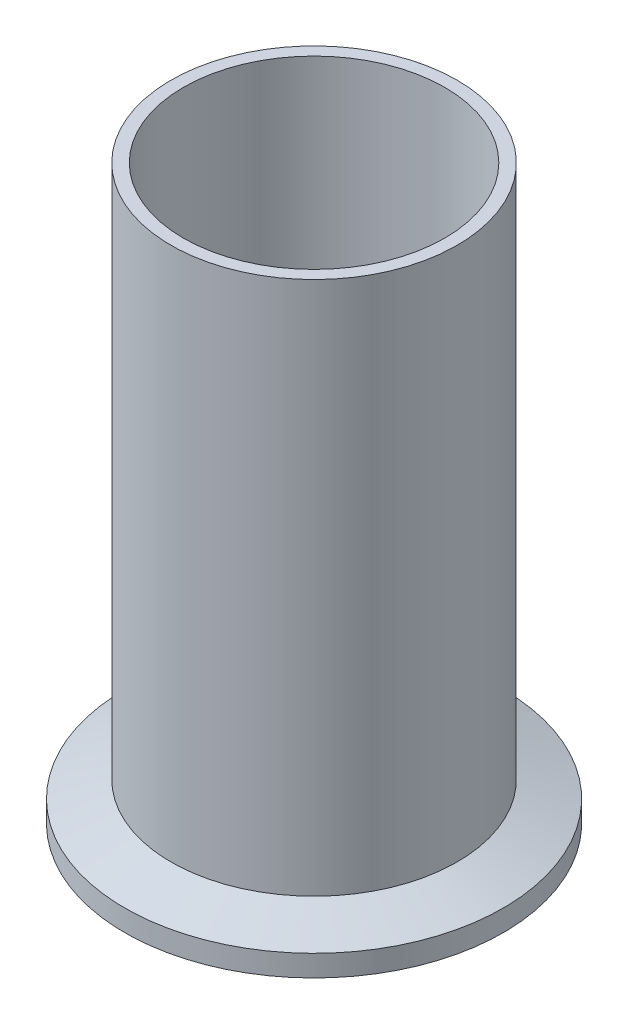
ISO-10303-21;
HEADER;
FILE_DESCRIPTION(('STEP AP214'),'2;1');
FILE_NAME('part.step','',(''),(''),'','','');
FILE_SCHEMA(('AUTOMOTIVE_DESIGN { 1 0 10303 214 1 1 1 1 }'));
ENDSEC;
DATA;
#1=APPLICATION_CONTEXT('core data for automotive mechanical design processes');
#2=APPLICATION_PROTOCOL_DEFINITION('international standard','automotive_design',2000,#1);
#3=PRODUCT_CONTEXT('',#1,'mechanical');
#4=PRODUCT('Part','Part','',(#3));
#5=PRODUCT_RELATED_PRODUCT_CATEGORY('part','',(#4));
#6=PRODUCT_DEFINITION_FORMATION('','',#4);
#7=PRODUCT_DEFINITION_CONTEXT('part definition',#1,'design');
#8=PRODUCT_DEFINITION('design','',#6,#7);
#9=PRODUCT_DEFINITION_SHAPE('','',#8);
#10=(LENGTH_UNIT() NAMED_UNIT(*) SI_UNIT(.MILLI.,.METRE.));
#11=(NAMED_UNIT(*) PLANE_ANGLE_UNIT() SI_UNIT($,.RADIAN.));
#12=(NAMED_UNIT(*) SI_UNIT($,.STERADIAN.) SOLID_ANGLE_UNIT());
#13=UNCERTAINTY_MEASURE_WITH_UNIT(LENGTH_MEASURE(1.E-05),#10,'distance_accuracy_value','');
#14=(GEOMETRIC_REPRESENTATION_CONTEXT(3) GLOBAL_UNCERTAINTY_ASSIGNED_CONTEXT((#13)) GLOBAL_UNIT_ASSIGNED_CONTEXT((#10,
#11,#12)) REPRESENTATION_CONTEXT('',''));
#15=CARTESIAN_POINT('',(0.,0.,0.));
#16=DIRECTION('',(0.,0.,1.));
#17=DIRECTION('',(1.,0.,0.));
#18=AXIS2_PLACEMENT_3D('',#15,#16,#17);
#19=CARTESIAN_POINT('',(0.,0.787399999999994,0.));
#20=DIRECTION('',(0.,-0.999999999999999,0.));
#21=DIRECTION('',(0.,0.,-0.999999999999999));
#22=AXIS2_PLACEMENT_3D('',#19,#20,#21);
#23=TOROIDAL_SURFACE('',#22,23.6366084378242,0.787399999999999);
#24=CARTESIAN_POINT('',(0.,0.,0.));
#25=DIRECTION('',(0.,-0.999999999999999,0.));
#26=DIRECTION('',(0.,0.,-0.999999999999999));
#27=AXIS2_PLACEMENT_3D('',#24,#25,#26);
#28=CIRCLE('',#27,23.6366084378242);
#29=CARTESIAN_POINT('',(0.,0.,-23.6366084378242));
#30=VERTEX_POINT('',#29);
#31=EDGE_CURVE('E74',#30,#30,#28,.T.);
#32=ORIENTED_EDGE('',*,*,#31,.T.);
#33=EDGE_LOOP('',(#32));
#34=FACE_BOUND('',#33,.T.);
#35=CARTESIAN_POINT('',(0.,0.474458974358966,0.));
#36=DIRECTION('',(0.,-0.999999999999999,0.));
#37=DIRECTION('',(0.,0.,-0.999999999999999));
#38=AXIS2_PLACEMENT_3D('',#35,#36,#37);
#39=CIRCLE('',#38,22.9140666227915);
#40=CARTESIAN_POINT('',(0.,0.474458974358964,-22.9140666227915));
#41=VERTEX_POINT('',#40);
#42=EDGE_CURVE('E12',#41,#41,#39,.T.);
#43=ORIENTED_EDGE('',*,*,#42,.F.);
#44=EDGE_LOOP('',(#43));
#45=FACE_BOUND('',#44,.T.);
#46=ADVANCED_FACE('F40',(#34,#45),#23,.T.);
#47=CARTESIAN_POINT('',(0.,0.,0.));
#48=DIRECTION('',(0.,-0.999999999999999,0.));
#49=DIRECTION('',(0.,0.,-0.999999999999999));
#50=AXIS2_PLACEMENT_3D('',#47,#48,#49);
#51=TOROIDAL_SURFACE('',#50,21.8186,1.1938);
#52=CARTESIAN_POINT('',(0.,0.474458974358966,0.));
#53=DIRECTION('',(0.,-0.999999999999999,0.));
#54=DIRECTION('',(0.,0.,-0.999999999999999));
#55=AXIS2_PLACEMENT_3D('',#52,#53,#54);
#56=CIRCLE('',#55,20.7231333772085);
#57=CARTESIAN_POINT('',(0.,0.474458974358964,-20.7231333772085));
#58=VERTEX_POINT('',#57);
#59=EDGE_CURVE('E46',#58,#58,#56,.T.);
#60=ORIENTED_EDGE('',*,*,#59,.F.);
#61=EDGE_LOOP('',(#60));
#62=FACE_BOUND('',#61,.T.);
#63=ORIENTED_EDGE('',*,*,#42,.T.);
#64=EDGE_LOOP('',(#63));
#65=FACE_BOUND('',#64,.T.);
#66=ADVANCED_FACE('F122',(#62,#65),#51,.F.);
#67=CARTESIAN_POINT('',(0.,0.787399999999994,0.));
#68=DIRECTION('',(0.,-0.999999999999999,0.));
#69=DIRECTION('',(0.,0.,-0.999999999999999));
#70=AXIS2_PLACEMENT_3D('',#67,#68,#69);
#71=TOROIDAL_SURFACE('',#70,20.0005915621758,0.787399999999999);
#72=ORIENTED_EDGE('',*,*,#59,.T.);
#73=EDGE_LOOP('',(#72));
#74=FACE_BOUND('',#73,.T.);
#75=CARTESIAN_POINT('',(0.,0.,0.));
#76=DIRECTION('',(0.,-0.999999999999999,0.));
#77=DIRECTION('',(0.,0.,-0.999999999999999));
#78=AXIS2_PLACEMENT_3D('',#75,#76,#77);
#79=CIRCLE('',#78,20.0005915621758);
#80=CARTESIAN_POINT('',(0.,0.,-20.0005915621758));
#81=VERTEX_POINT('',#80);
#82=EDGE_CURVE('E50',#81,#81,#79,.T.);
#83=ORIENTED_EDGE('',*,*,#82,.F.);
#84=EDGE_LOOP('',(#83));
#85=FACE_BOUND('',#84,.T.);
#86=ADVANCED_FACE('F118',(#74,#85),#71,.T.);
#87=CARTESIAN_POINT('',(0.,0.,0.));
#88=DIRECTION('',(0.,0.999999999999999,0.));
#89=DIRECTION('',(0.,0.,0.999999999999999));
#90=AXIS2_PLACEMENT_3D('',#87,#88,#89);
#91=PLANE('',#90);
#92=CARTESIAN_POINT('',(0.,0.,0.));
#93=DIRECTION('',(0.,-0.999999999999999,0.));
#94=DIRECTION('',(0.,0.,-0.999999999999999));
#95=AXIS2_PLACEMENT_3D('',#92,#93,#94);
#96=CIRCLE('',#95,17.399);
#97=CARTESIAN_POINT('',(0.,0.,-17.399));
#98=VERTEX_POINT('',#97);
#99=EDGE_CURVE('E54',#98,#98,#96,.T.);
#100=ORIENTED_EDGE('',*,*,#99,.F.);
#101=EDGE_LOOP('',(#100));
#102=FACE_BOUND('',#101,.T.);
#103=ORIENTED_EDGE('',*,*,#82,.T.);
#104=EDGE_LOOP('',(#103));
#105=FACE_BOUND('',#104,.T.);
#106=ADVANCED_FACE('F112',(#102,#105),#91,.F.);
#107=CARTESIAN_POINT('',(0.,0.,0.));
#108=DIRECTION('',(0.,-0.999999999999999,0.));
#109=DIRECTION('',(0.,0.,-0.999999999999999));
#110=AXIS2_PLACEMENT_3D('',#107,#108,#109);
#111=CYLINDRICAL_SURFACE('',#110,17.399);
#112=CARTESIAN_POINT('',(0.,76.1999999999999,0.));
#113=DIRECTION('',(0.,-0.999999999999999,0.));
#114=DIRECTION('',(0.,0.,-0.999999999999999));
#115=AXIS2_PLACEMENT_3D('',#112,#113,#114);
#116=CIRCLE('',#115,17.399);
#117=CARTESIAN_POINT('',(0.,76.1999999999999,-17.399));
#118=VERTEX_POINT('',#117);
#119=EDGE_CURVE('E59',#118,#118,#116,.T.);
#120=CARTESIAN_POINT('',(0.,0.,-17.399));
#121=CARTESIAN_POINT('',(0.,0.793749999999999,-17.399));
#122=CARTESIAN_POINT('',(0.,1.5875,-17.399));
#123=CARTESIAN_POINT('',(0.,3.175,-17.399));
#124=CARTESIAN_POINT('',(0.,3.96875,-17.399));
#125=CARTESIAN_POINT('',(0.,5.55624999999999,-17.399));
#126=CARTESIAN_POINT('',(0.,6.34999999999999,-17.399));
#127=CARTESIAN_POINT('',(0.,7.93749999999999,-17.399));
#128=CARTESIAN_POINT('',(0.,8.73124999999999,-17.399));
#129=CARTESIAN_POINT('',(0.,10.31875,-17.399));
#130=CARTESIAN_POINT('',(0.,11.1125,-17.399));
#131=CARTESIAN_POINT('',(0.,12.7,-17.399));
#132=CARTESIAN_POINT('',(0.,13.49375,-17.399));
#133=CARTESIAN_POINT('',(0.,15.08125,-17.399));
#134=CARTESIAN_POINT('',(0.,15.875,-17.399));
#135=CARTESIAN_POINT('',(0.,17.4625,-17.399));
#136=CARTESIAN_POINT('',(0.,18.25625,-17.399));
#137=CARTESIAN_POINT('',(0.,19.84375,-17.399));
#138=CARTESIAN_POINT('',(0.,20.6375,-17.399));
#139=CARTESIAN_POINT('',(0.,22.225,-17.399));
#140=CARTESIAN_POINT('',(0.,23.01875,-17.399));
#141=CARTESIAN_POINT('',(0.,24.60625,-17.399));
#142=CARTESIAN_POINT('',(0.,25.4,-17.399));
#143=CARTESIAN_POINT('',(0.,26.9875,-17.399));
#144=CARTESIAN_POINT('',(0.,27.78125,-17.399));
#145=CARTESIAN_POINT('',(0.,29.36875,-17.399));
#146=CARTESIAN_POINT('',(0.,30.1625,-17.399));
#147=CARTESIAN_POINT('',(0.,31.75,-17.399));
#148=CARTESIAN_POINT('',(0.,32.54375,-17.399));
#149=CARTESIAN_POINT('',(0.,34.13125,-17.399));
#150=CARTESIAN_POINT('',(0.,34.9249999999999,-17.399));
#151=CARTESIAN_POINT('',(0.,36.5124999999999,-17.399));
#152=CARTESIAN_POINT('',(0.,37.3062499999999,-17.399));
#153=CARTESIAN_POINT('',(0.,38.8937499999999,-17.399));
#154=CARTESIAN_POINT('',(0.,39.6874999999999,-17.399));
#155=CARTESIAN_POINT('',(0.,41.2749999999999,-17.399));
#156=CARTESIAN_POINT('',(0.,42.0687499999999,-17.399));
#157=CARTESIAN_POINT('',(0.,43.6562499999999,-17.399));
#158=CARTESIAN_POINT('',(0.,44.4499999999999,-17.399));
#159=CARTESIAN_POINT('',(0.,46.0374999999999,-17.399));
#160=CARTESIAN_POINT('',(0.,46.8312499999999,-17.399));
#161=CARTESIAN_POINT('',(0.,48.4187499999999,-17.399));
#162=CARTESIAN_POINT('',(0.,49.2124999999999,-17.399));
#163=CARTESIAN_POINT('',(0.,50.7999999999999,-17.399));
#164=CARTESIAN_POINT('',(0.,51.5937499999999,-17.399));
#165=CARTESIAN_POINT('',(0.,53.1812499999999,-17.399));
#166=CARTESIAN_POINT('',(0.,53.9749999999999,-17.399));
#167=CARTESIAN_POINT('',(0.,55.5624999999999,-17.399));
#168=CARTESIAN_POINT('',(0.,56.3562499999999,-17.399));
#169=CARTESIAN_POINT('',(0.,57.9437499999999,-17.399));
#170=CARTESIAN_POINT('',(0.,58.7374999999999,-17.399));
#171=CARTESIAN_POINT('',(0.,60.3249999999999,-17.399));
#172=CARTESIAN_POINT('',(0.,61.1187499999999,-17.399));
#173=CARTESIAN_POINT('',(0.,62.7062499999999,-17.399));
#174=CARTESIAN_POINT('',(0.,63.4999999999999,-17.399));
#175=CARTESIAN_POINT('',(0.,65.0874999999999,-17.399));
#176=CARTESIAN_POINT('',(0.,65.8812499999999,-17.399));
#177=CARTESIAN_POINT('',(0.,67.4687499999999,-17.399));
#178=CARTESIAN_POINT('',(0.,68.2624999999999,-17.399));
#179=CARTESIAN_POINT('',(0.,69.8499999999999,-17.399));
#180=CARTESIAN_POINT('',(0.,70.6437499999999,-17.399));
#181=CARTESIAN_POINT('',(0.,72.2312499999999,-17.399));
#182=CARTESIAN_POINT('',(0.,73.0249999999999,-17.399));
#183=CARTESIAN_POINT('',(0.,74.6124999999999,-17.399));
#184=CARTESIAN_POINT('',(0.,75.4062499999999,-17.399));
#185=CARTESIAN_POINT('',(0.,76.1999999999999,-17.399));
#186=B_SPLINE_CURVE_WITH_KNOTS('',3,(#120,#121,#122,#123,#124,#125,#126,#127,#128,#129,#130,
#131,#132,#133,#134,#135,#136,#137,#138,#139,#140,#141,#142,#143,#144,#145,#146,#147,#148,#149,
#150,#151,#152,#153,#154,#155,#156,#157,#158,#159,#160,#161,#162,#163,#164,#165,#166,#167,#168,
#169,#170,#171,#172,#173,#174,#175,#176,#177,#178,#179,#180,#181,#182,#183,#184,#185),
.UNSPECIFIED.,.F.,.F.,(4,2,2,2,2,2,2,2,2,2,2,2,2,2,2,2,2,2,2,2,2,2,2,2,2,2,2,2,2,2,2,2,4),(0.,
2.38125,4.76249999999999,7.14374999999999,9.52499999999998,11.90625,14.2875,16.66875,19.05,
21.43125,23.8125,26.19375,28.575,30.95625,33.3375,35.7187499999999,38.0999999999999,
40.4812499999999,42.8624999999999,45.2437499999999,47.6249999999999,50.0062499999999,
52.3874999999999,54.7687499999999,57.1499999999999,59.5312499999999,61.9124999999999,
64.2937499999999,66.6749999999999,69.0562499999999,71.4374999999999,73.8187499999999,
76.1999999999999),.UNSPECIFIED.);
#187=EDGE_CURVE('BSEAM107',#98,#118,#186,.T.);
#188=ORIENTED_EDGE('',*,*,#99,.T.);
#189=ORIENTED_EDGE('',*,*,#119,.F.);
#190=ORIENTED_EDGE('',*,*,#187,.T.);
#191=ORIENTED_EDGE('',*,*,#187,.F.);
#192=EDGE_LOOP('',(#188,#190,#189,#191));
#193=FACE_BOUND('',#192,.T.);
#194=ADVANCED_FACE('F107',(#193),#111,.F.);
#195=CARTESIAN_POINT('',(0.,76.1999999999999,0.));
#196=DIRECTION('',(0.,-0.999999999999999,0.));
#197=DIRECTION('',(0.,0.,-0.999999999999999));
#198=AXIS2_PLACEMENT_3D('',#195,#196,#197);
#199=PLANE('',#198);
#200=CARTESIAN_POINT('',(0.,76.1999999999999,0.));
#201=DIRECTION('',(0.,-0.999999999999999,0.));
#202=DIRECTION('',(0.,0.,-0.999999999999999));
#203=AXIS2_PLACEMENT_3D('',#200,#201,#202);
#204=CIRCLE('',#203,19.05);
#205=CARTESIAN_POINT('',(0.,76.1999999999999,-19.05));
#206=VERTEX_POINT('',#205);
#207=EDGE_CURVE('E62',#206,#206,#204,.T.);
#208=ORIENTED_EDGE('',*,*,#207,.F.);
#209=EDGE_LOOP('',(#208));
#210=FACE_BOUND('',#209,.T.);
#211=ORIENTED_EDGE('',*,*,#119,.T.);
#212=EDGE_LOOP('',(#211));
#213=FACE_BOUND('',#212,.T.);
#214=ADVANCED_FACE('F101',(#210,#213),#199,.F.);
#215=CARTESIAN_POINT('',(0.,0.,0.));
#216=DIRECTION('',(0.,-0.999999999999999,0.));
#217=DIRECTION('',(0.,0.,-0.999999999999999));
#218=AXIS2_PLACEMENT_3D('',#215,#216,#217);
#219=CYLINDRICAL_SURFACE('',#218,19.05);
#220=CARTESIAN_POINT('',(0.,5.08205223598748,0.));
#221=DIRECTION('',(0.,-0.999999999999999,0.));
#222=DIRECTION('',(0.,0.,-0.999999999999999));
#223=AXIS2_PLACEMENT_3D('',#220,#221,#222);
#224=CIRCLE('',#223,19.05);
#225=CARTESIAN_POINT('',(0.,5.08205223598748,-19.05));
#226=VERTEX_POINT('',#225);
#227=EDGE_CURVE('E65',#226,#226,#224,.T.);
#228=CARTESIAN_POINT('',(0.,5.08205223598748,-19.05));
#229=CARTESIAN_POINT('',(0.,5.82286419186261,-19.05));
#230=CARTESIAN_POINT('',(0.,6.56367614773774,-19.05));
#231=CARTESIAN_POINT('',(0.,8.045300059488,-19.05));
#232=CARTESIAN_POINT('',(0.,8.78611201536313,-19.05));
#233=CARTESIAN_POINT('',(0.,10.2677359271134,-19.05));
#234=CARTESIAN_POINT('',(0.,11.0085478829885,-19.05));
#235=CARTESIAN_POINT('',(0.,12.4901717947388,-19.05));
#236=CARTESIAN_POINT('',(0.,13.2309837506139,-19.05));
#237=CARTESIAN_POINT('',(0.,14.7126076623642,-19.05));
#238=CARTESIAN_POINT('',(0.,15.4534196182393,-19.05));
#239=CARTESIAN_POINT('',(0.,16.9350435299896,-19.05));
#240=CARTESIAN_POINT('',(0.,17.6758554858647,-19.05));
#241=CARTESIAN_POINT('',(0.,19.1574793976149,-19.05));
#242=CARTESIAN_POINT('',(0.,19.8982913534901,-19.05));
#243=CARTESIAN_POINT('',(0.,21.3799152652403,-19.05));
#244=CARTESIAN_POINT('',(0.,22.1207272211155,-19.05));
#245=CARTESIAN_POINT('',(0.,23.6023511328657,-19.05));
#246=CARTESIAN_POINT('',(0.,24.3431630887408,-19.05));
#247=CARTESIAN_POINT('',(0.,25.8247870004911,-19.05));
#248=CARTESIAN_POINT('',(0.,26.5655989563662,-19.05));
#249=CARTESIAN_POINT('',(0.,28.0472228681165,-19.05));
#250=CARTESIAN_POINT('',(0.,28.7880348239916,-19.05));
#251=CARTESIAN_POINT('',(0.,30.2696587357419,-19.05));
#252=CARTESIAN_POINT('',(0.,31.010470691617,-19.05));
#253=CARTESIAN_POINT('',(0.,32.4920946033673,-19.05));
#254=CARTESIAN_POINT('',(0.,33.2329065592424,-19.05));
#255=CARTESIAN_POINT('',(0.,34.7145304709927,-19.05));
#256=CARTESIAN_POINT('',(0.,35.4553424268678,-19.05));
#257=CARTESIAN_POINT('',(0.,36.936966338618,-19.05));
#258=CARTESIAN_POINT('',(0.,37.6777782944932,-19.05));
#259=CARTESIAN_POINT('',(0.,39.1594022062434,-19.05));
#260=CARTESIAN_POINT('',(0.,39.9002141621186,-19.05));
#261=CARTESIAN_POINT('',(0.,41.3818380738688,-19.05));
#262=CARTESIAN_POINT('',(0.,42.122650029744,-19.05));
#263=CARTESIAN_POINT('',(0.,43.6042739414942,-19.05));
#264=CARTESIAN_POINT('',(0.,44.3450858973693,-19.05));
#265=CARTESIAN_POINT('',(0.,45.8267098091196,-19.05));
#266=CARTESIAN_POINT('',(0.,46.5675217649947,-19.05));
#267=CARTESIAN_POINT('',(0.,48.049145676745,-19.05));
#268=CARTESIAN_POINT('',(0.,48.7899576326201,-19.05));
#269=CARTESIAN_POINT('',(0.,50.2715815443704,-19.05));
#270=CARTESIAN_POINT('',(0.,51.0123935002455,-19.05));
#271=CARTESIAN_POINT('',(0.,52.4940174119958,-19.05));
#272=CARTESIAN_POINT('',(0.,53.2348293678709,-19.05));
#273=CARTESIAN_POINT('',(0.,54.7164532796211,-19.05));
#274=CARTESIAN_POINT('',(0.,55.4572652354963,-19.05));
#275=CARTESIAN_POINT('',(0.,56.9388891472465,-19.05));
#276=CARTESIAN_POINT('',(0.,57.6797011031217,-19.05));
#277=CARTESIAN_POINT('',(0.,59.1613250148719,-19.05));
#278=CARTESIAN_POINT('',(0.,59.9021369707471,-19.05));
#279=CARTESIAN_POINT('',(0.,61.3837608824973,-19.05));
#280=CARTESIAN_POINT('',(0.,62.1245728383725,-19.05));
#281=CARTESIAN_POINT('',(0.,63.6061967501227,-19.05));
#282=CARTESIAN_POINT('',(0.,64.3470087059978,-19.05));
#283=CARTESIAN_POINT('',(0.,65.8286326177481,-19.05));
#284=CARTESIAN_POINT('',(0.,66.5694445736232,-19.05));
#285=CARTESIAN_POINT('',(0.,68.0510684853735,-19.05));
#286=CARTESIAN_POINT('',(0.,68.7918804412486,-19.05));
#287=CARTESIAN_POINT('',(0.,70.2735043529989,-19.05));
#288=CARTESIAN_POINT('',(0.,71.014316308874,-19.05));
#289=CARTESIAN_POINT('',(0.,72.4959402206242,-19.05));
#290=CARTESIAN_POINT('',(0.,73.2367521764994,-19.05));
#291=CARTESIAN_POINT('',(0.,74.7183760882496,-19.05));
#292=CARTESIAN_POINT('',(0.,75.4591880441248,-19.05));
#293=CARTESIAN_POINT('',(0.,76.1999999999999,-19.05));
#294=B_SPLINE_CURVE_WITH_KNOTS('',3,(#228,#229,#230,#231,#232,#233,#234,#235,#236,#237,#238,
#239,#240,#241,#242,#243,#244,#245,#246,#247,#248,#249,#250,#251,#252,#253,#254,#255,#256,#257,
#258,#259,#260,#261,#262,#263,#264,#265,#266,#267,#268,#269,#270,#271,#272,#273,#274,#275,#276,
#277,#278,#279,#280,#281,#282,#283,#284,#285,#286,#287,#288,#289,#290,#291,#292,#293),
.UNSPECIFIED.,.F.,.F.,(4,2,2,2,2,2,2,2,2,2,2,2,2,2,2,2,2,2,2,2,2,2,2,2,2,2,2,2,2,2,2,2,4),(0.,
2.22243586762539,4.44487173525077,6.66730760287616,8.88974347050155,11.1121793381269,
13.3346152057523,15.5570510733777,17.7794869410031,20.0019228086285,22.2243586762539,
24.4467945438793,26.6692304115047,28.89166627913,31.1141021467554,33.3365380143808,
35.5589738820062,37.7814097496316,40.003845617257,42.2262814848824,44.4487173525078,
46.6711532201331,48.8935890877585,51.1160249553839,53.3384608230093,55.5608966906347,
57.7833325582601,60.0057684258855,62.2282042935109,64.4506401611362,66.6730760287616,
68.895511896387,71.1179477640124),.UNSPECIFIED.);
#295=EDGE_CURVE('BSEAM95',#226,#206,#294,.T.);
#296=ORIENTED_EDGE('',*,*,#227,.F.);
#297=ORIENTED_EDGE('',*,*,#207,.T.);
#298=ORIENTED_EDGE('',*,*,#295,.T.);
#299=ORIENTED_EDGE('',*,*,#295,.F.);
#300=EDGE_LOOP('',(#296,#298,#297,#299));
#301=FACE_BOUND('',#300,.T.);
#302=ADVANCED_FACE('F95',(#301),#219,.T.);
#303=CARTESIAN_POINT('',(0.,5.08205223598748,0.));
#304=DIRECTION('',(0.,-0.999999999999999,0.));
#305=DIRECTION('',(0.,0.,-0.999999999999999));
#306=AXIS2_PLACEMENT_3D('',#303,#304,#305);
#307=CONICAL_SURFACE('',#306,19.05,1.22173047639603);
#308=CARTESIAN_POINT('',(0.,2.84480000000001,0.));
#309=DIRECTION('',(0.,-0.999999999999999,0.));
#310=DIRECTION('',(0.,0.,-0.999999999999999));
#311=AXIS2_PLACEMENT_3D('',#308,#309,#310);
#312=CIRCLE('',#311,25.1968);
#313=CARTESIAN_POINT('',(0.,2.84480000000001,-25.1968));
#314=VERTEX_POINT('',#313);
#315=EDGE_CURVE('E68',#314,#314,#312,.T.);
#316=CARTESIAN_POINT('',(0.,2.84480000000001,-25.1968));
#317=CARTESIAN_POINT('',(0.,2.86810471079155,-25.1327708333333));
#318=CARTESIAN_POINT('',(0.,2.89140942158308,-25.0687416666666));
#319=CARTESIAN_POINT('',(0.,2.93801884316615,-24.9406833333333));
#320=CARTESIAN_POINT('',(0.,2.96132355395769,-24.8766541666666));
#321=CARTESIAN_POINT('',(0.,3.00793297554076,-24.7485958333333));
#322=CARTESIAN_POINT('',(0.,3.0312376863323,-24.6845666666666));
#323=CARTESIAN_POINT('',(0.,3.07784710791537,-24.5565083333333));
#324=CARTESIAN_POINT('',(0.,3.10115181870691,-24.4924791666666));
#325=CARTESIAN_POINT('',(0.,3.14776124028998,-24.3644208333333));
#326=CARTESIAN_POINT('',(0.,3.17106595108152,-24.3003916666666));
#327=CARTESIAN_POINT('',(0.,3.21767537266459,-24.1723333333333));
#328=CARTESIAN_POINT('',(0.,3.24098008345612,-24.1083041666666));
#329=CARTESIAN_POINT('',(0.,3.2875895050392,-23.9802458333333));
#330=CARTESIAN_POINT('',(0.,3.31089421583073,-23.9162166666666));
#331=CARTESIAN_POINT('',(0.,3.35750363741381,-23.7881583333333));
#332=CARTESIAN_POINT('',(0.,3.38080834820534,-23.7241291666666));
#333=CARTESIAN_POINT('',(0.,3.42741776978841,-23.5960708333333));
#334=CARTESIAN_POINT('',(0.,3.45072248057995,-23.5320416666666));
#335=CARTESIAN_POINT('',(0.,3.49733190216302,-23.4039833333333));
#336=CARTESIAN_POINT('',(0.,3.52063661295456,-23.3399541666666));
#337=CARTESIAN_POINT('',(0.,3.56724603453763,-23.2118958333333));
#338=CARTESIAN_POINT('',(0.,3.59055074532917,-23.1478666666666));
#339=CARTESIAN_POINT('',(0.,3.63716016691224,-23.0198083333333));
#340=CARTESIAN_POINT('',(0.,3.66046487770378,-22.9557791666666));
#341=CARTESIAN_POINT('',(0.,3.70707429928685,-22.8277208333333));
#342=CARTESIAN_POINT('',(0.,3.73037901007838,-22.7636916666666));
#343=CARTESIAN_POINT('',(0.,3.77698843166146,-22.6356333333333));
#344=CARTESIAN_POINT('',(0.,3.80029314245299,-22.5716041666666));
#345=CARTESIAN_POINT('',(0.,3.84690256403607,-22.4435458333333));
#346=CARTESIAN_POINT('',(0.,3.8702072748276,-22.3795166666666));
#347=CARTESIAN_POINT('',(0.,3.91681669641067,-22.2514583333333));
#348=CARTESIAN_POINT('',(0.,3.94012140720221,-22.1874291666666));
#349=CARTESIAN_POINT('',(0.,3.98673082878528,-22.0593708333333));
#350=CARTESIAN_POINT('',(0.,4.01003553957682,-21.9953416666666));
#351=CARTESIAN_POINT('',(0.,4.05664496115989,-21.8672833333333));
#352=CARTESIAN_POINT('',(0.,4.07994967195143,-21.8032541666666));
#353=CARTESIAN_POINT('',(0.,4.1265590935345,-21.6751958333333));
#354=CARTESIAN_POINT('',(0.,4.14986380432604,-21.6111666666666));
#355=CARTESIAN_POINT('',(0.,4.19647322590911,-21.4831083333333));
#356=CARTESIAN_POINT('',(0.,4.21977793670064,-21.4190791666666));
#357=CARTESIAN_POINT('',(0.,4.26638735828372,-21.2910208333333));
#358=CARTESIAN_POINT('',(0.,4.28969206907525,-21.2269916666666));
#359=CARTESIAN_POINT('',(0.,4.33630149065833,-21.0989333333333));
#360=CARTESIAN_POINT('',(0.,4.35960620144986,-21.0349041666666));
#361=CARTESIAN_POINT('',(0.,4.40621562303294,-20.9068458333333));
#362=CARTESIAN_POINT('',(0.,4.42952033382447,-20.8428166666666));
#363=CARTESIAN_POINT('',(0.,4.47612975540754,-20.7147583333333));
#364=CARTESIAN_POINT('',(0.,4.49943446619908,-20.6507291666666));
#365=CARTESIAN_POINT('',(0.,4.54604388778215,-20.5226708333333));
#366=CARTESIAN_POINT('',(0.,4.56934859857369,-20.4586416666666));
#367=CARTESIAN_POINT('',(0.,4.61595802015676,-20.3305833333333));
#368=CARTESIAN_POINT('',(0.,4.6392627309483,-20.2665541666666));
#369=CARTESIAN_POINT('',(0.,4.68587215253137,-20.1384958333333));
#370=CARTESIAN_POINT('',(0.,4.70917686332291,-20.0744666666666));
#371=CARTESIAN_POINT('',(0.,4.75578628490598,-19.9464083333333));
#372=CARTESIAN_POINT('',(0.,4.77909099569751,-19.8823791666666));
#373=CARTESIAN_POINT('',(0.,4.82570041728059,-19.7543208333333));
#374=CARTESIAN_POINT('',(0.,4.84900512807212,-19.6902916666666));
#375=CARTESIAN_POINT('',(0.,4.8956145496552,-19.5622333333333));
#376=CARTESIAN_POINT('',(0.,4.91891926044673,-19.4982041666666));
#377=CARTESIAN_POINT('',(0.,4.9655286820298,-19.3701458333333));
#378=CARTESIAN_POINT('',(0.,4.98883339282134,-19.3061166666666));
#379=CARTESIAN_POINT('',(0.,5.03544281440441,-19.1780583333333));
#380=CARTESIAN_POINT('',(0.,5.05874752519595,-19.1140291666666));
#381=CARTESIAN_POINT('',(0.,5.08205223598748,-19.05));
#382=B_SPLINE_CURVE_WITH_KNOTS('',3,(#316,#317,#318,#319,#320,#321,#322,#323,#324,#325,#326,
#327,#328,#329,#330,#331,#332,#333,#334,#335,#336,#337,#338,#339,#340,#341,#342,#343,#344,#345,
#346,#347,#348,#349,#350,#351,#352,#353,#354,#355,#356,#357,#358,#359,#360,#361,#362,#363,#364,
#365,#366,#367,#368,#369,#370,#371,#372,#373,#374,#375,#376,#377,#378,#379,#380,#381),
.UNSPECIFIED.,.F.,.F.,(4,2,2,2,2,2,2,2,2,2,2,2,2,2,2,2,2,2,2,2,2,2,2,2,2,2,2,2,2,2,2,2,4),(0.,
0.204415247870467,0.408830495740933,0.613245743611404,0.81766099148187,1.02207623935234,
1.2264914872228,1.43090673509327,1.63532198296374,1.8397372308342,2.04415247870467,
2.24856772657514,2.4529829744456,2.65739822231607,2.86181347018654,3.066228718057,
3.27064396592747,3.47505921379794,3.67947446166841,3.88388970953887,4.08830495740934,
4.2927202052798,4.49713545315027,4.70155070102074,4.9059659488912,5.11038119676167,
5.31479644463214,5.5192116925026,5.72362694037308,5.92804218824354,6.13245743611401,
6.33687268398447,6.54128793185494),.UNSPECIFIED.);
#383=EDGE_CURVE('BSEAM89',#314,#226,#382,.T.);
#384=ORIENTED_EDGE('',*,*,#315,.F.);
#385=ORIENTED_EDGE('',*,*,#227,.T.);
#386=ORIENTED_EDGE('',*,*,#383,.T.);
#387=ORIENTED_EDGE('',*,*,#383,.F.);
#388=EDGE_LOOP('',(#384,#386,#385,#387));
#389=FACE_BOUND('',#388,.T.);
#390=ADVANCED_FACE('F89',(#389),#307,.T.);
#391=CARTESIAN_POINT('',(0.,0.,0.));
#392=DIRECTION('',(0.,-0.999999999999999,0.));
#393=DIRECTION('',(0.,0.,-0.999999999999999));
#394=AXIS2_PLACEMENT_3D('',#391,#392,#393);
#395=CYLINDRICAL_SURFACE('',#394,25.1968);
#396=CARTESIAN_POINT('',(0.,0.,0.));
#397=DIRECTION('',(0.,-0.999999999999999,0.));
#398=DIRECTION('',(0.,0.,-0.999999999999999));
#399=AXIS2_PLACEMENT_3D('',#396,#397,#398);
#400=CIRCLE('',#399,25.1968);
#401=CARTESIAN_POINT('',(0.,0.,-25.1968));
#402=VERTEX_POINT('',#401);
#403=EDGE_CURVE('E71',#402,#402,#400,.T.);
#404=CARTESIAN_POINT('',(0.,0.,-25.1968));
#405=CARTESIAN_POINT('',(0.,0.029633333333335,-25.1968));
#406=CARTESIAN_POINT('',(0.,0.0592666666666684,-25.1968));
#407=CARTESIAN_POINT('',(0.,0.118533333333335,-25.1968));
#408=CARTESIAN_POINT('',(0.,0.148166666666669,-25.1968));
#409=CARTESIAN_POINT('',(0.,0.207433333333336,-25.1968));
#410=CARTESIAN_POINT('',(0.,0.237066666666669,-25.1968));
#411=CARTESIAN_POINT('',(0.,0.296333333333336,-25.1968));
#412=CARTESIAN_POINT('',(0.,0.325966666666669,-25.1968));
#413=CARTESIAN_POINT('',(0.,0.385233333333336,-25.1968));
#414=CARTESIAN_POINT('',(0.,0.41486666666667,-25.1968));
#415=CARTESIAN_POINT('',(0.,0.474133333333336,-25.1968));
#416=CARTESIAN_POINT('',(0.,0.50376666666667,-25.1968));
#417=CARTESIAN_POINT('',(0.,0.563033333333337,-25.1968));
#418=CARTESIAN_POINT('',(0.,0.59266666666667,-25.1968));
#419=CARTESIAN_POINT('',(0.,0.651933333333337,-25.1968));
#420=CARTESIAN_POINT('',(0.,0.68156666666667,-25.1968));
#421=CARTESIAN_POINT('',(0.,0.740833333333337,-25.1968));
#422=CARTESIAN_POINT('',(0.,0.770466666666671,-25.1968));
#423=CARTESIAN_POINT('',(0.,0.829733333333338,-25.1968));
#424=CARTESIAN_POINT('',(0.,0.859366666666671,-25.1968));
#425=CARTESIAN_POINT('',(0.,0.918633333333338,-25.1968));
#426=CARTESIAN_POINT('',(0.,0.948266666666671,-25.1968));
#427=CARTESIAN_POINT('',(0.,1.00753333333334,-25.1968));
#428=CARTESIAN_POINT('',(0.,1.03716666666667,-25.1968));
#429=CARTESIAN_POINT('',(0.,1.09643333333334,-25.1968));
#430=CARTESIAN_POINT('',(0.,1.12606666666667,-25.1968));
#431=CARTESIAN_POINT('',(0.,1.18533333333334,-25.1968));
#432=CARTESIAN_POINT('',(0.,1.21496666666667,-25.1968));
#433=CARTESIAN_POINT('',(0.,1.27423333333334,-25.1968));
#434=CARTESIAN_POINT('',(0.,1.30386666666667,-25.1968));
#435=CARTESIAN_POINT('',(0.,1.36313333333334,-25.1968));
#436=CARTESIAN_POINT('',(0.,1.39276666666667,-25.1968));
#437=CARTESIAN_POINT('',(0.,1.45203333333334,-25.1968));
#438=CARTESIAN_POINT('',(0.,1.48166666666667,-25.1968));
#439=CARTESIAN_POINT('',(0.,1.54093333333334,-25.1968));
#440=CARTESIAN_POINT('',(0.,1.57056666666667,-25.1968));
#441=CARTESIAN_POINT('',(0.,1.62983333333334,-25.1968));
#442=CARTESIAN_POINT('',(0.,1.65946666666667,-25.1968));
#443=CARTESIAN_POINT('',(0.,1.71873333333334,-25.1968));
#444=CARTESIAN_POINT('',(0.,1.74836666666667,-25.1968));
#445=CARTESIAN_POINT('',(0.,1.80763333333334,-25.1968));
#446=CARTESIAN_POINT('',(0.,1.83726666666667,-25.1968));
#447=CARTESIAN_POINT('',(0.,1.89653333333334,-25.1968));
#448=CARTESIAN_POINT('',(0.,1.92616666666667,-25.1968));
#449=CARTESIAN_POINT('',(0.,1.98543333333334,-25.1968));
#450=CARTESIAN_POINT('',(0.,2.01506666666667,-25.1968));
#451=CARTESIAN_POINT('',(0.,2.07433333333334,-25.1968));
#452=CARTESIAN_POINT('',(0.,2.10396666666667,-25.1968));
#453=CARTESIAN_POINT('',(0.,2.16323333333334,-25.1968));
#454=CARTESIAN_POINT('',(0.,2.19286666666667,-25.1968));
#455=CARTESIAN_POINT('',(0.,2.25213333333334,-25.1968));
#456=CARTESIAN_POINT('',(0.,2.28176666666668,-25.1968));
#457=CARTESIAN_POINT('',(0.,2.34103333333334,-25.1968));
#458=CARTESIAN_POINT('',(0.,2.37066666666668,-25.1968));
#459=CARTESIAN_POINT('',(0.,2.42993333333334,-25.1968));
#460=CARTESIAN_POINT('',(0.,2.45956666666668,-25.1968));
#461=CARTESIAN_POINT('',(0.,2.51883333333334,-25.1968));
#462=CARTESIAN_POINT('',(0.,2.54846666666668,-25.1968));
#463=CARTESIAN_POINT('',(0.,2.60773333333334,-25.1968));
#464=CARTESIAN_POINT('',(0.,2.63736666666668,-25.1968));
#465=CARTESIAN_POINT('',(0.,2.69663333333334,-25.1968));
#466=CARTESIAN_POINT('',(0.,2.72626666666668,-25.1968));
#467=CARTESIAN_POINT('',(0.,2.78553333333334,-25.1968));
#468=CARTESIAN_POINT('',(0.,2.81516666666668,-25.1968));
#469=CARTESIAN_POINT('',(0.,2.84480000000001,-25.1968));
#470=B_SPLINE_CURVE_WITH_KNOTS('',3,(#404,#405,#406,#407,#408,#409,#410,#411,#412,#413,#414,
#415,#416,#417,#418,#419,#420,#421,#422,#423,#424,#425,#426,#427,#428,#429,#430,#431,#432,#433,
#434,#435,#436,#437,#438,#439,#440,#441,#442,#443,#444,#445,#446,#447,#448,#449,#450,#451,#452,
#453,#454,#455,#456,#457,#458,#459,#460,#461,#462,#463,#464,#465,#466,#467,#468,#469),
.UNSPECIFIED.,.F.,.F.,(4,2,2,2,2,2,2,2,2,2,2,2,2,2,2,2,2,2,2,2,2,2,2,2,2,2,2,2,2,2,2,2,4),(0.,
0.0889000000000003,0.177800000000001,0.266700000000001,0.355600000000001,0.444500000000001,
0.533400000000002,0.622300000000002,0.711200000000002,0.800100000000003,0.889000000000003,
0.977900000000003,1.0668,1.1557,1.2446,1.3335,1.4224,1.5113,1.6002,1.68910000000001,
1.77800000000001,1.86690000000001,1.95580000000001,2.04470000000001,2.13360000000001,
2.22250000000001,2.31140000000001,2.40030000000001,2.48920000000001,2.57810000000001,
2.66700000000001,2.75590000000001,2.84480000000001),.UNSPECIFIED.);
#471=EDGE_CURVE('BSEAM83',#402,#314,#470,.T.);
#472=ORIENTED_EDGE('',*,*,#403,.F.);
#473=ORIENTED_EDGE('',*,*,#315,.T.);
#474=ORIENTED_EDGE('',*,*,#471,.T.);
#475=ORIENTED_EDGE('',*,*,#471,.F.);
#476=EDGE_LOOP('',(#472,#474,#473,#475));
#477=FACE_BOUND('',#476,.T.);
#478=ADVANCED_FACE('F83',(#477),#395,.T.);
#479=CARTESIAN_POINT('',(0.,0.,0.));
#480=DIRECTION('',(0.,0.999999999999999,0.));
#481=DIRECTION('',(0.,0.,0.999999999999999));
#482=AXIS2_PLACEMENT_3D('',#479,#480,#481);
#483=PLANE('',#482);
#484=ORIENTED_EDGE('',*,*,#31,.F.);
#485=EDGE_LOOP('',(#484));
#486=FACE_BOUND('',#485,.T.);
#487=ORIENTED_EDGE('',*,*,#403,.T.);
#488=EDGE_LOOP('',(#487));
#489=FACE_BOUND('',#488,.T.);
#490=ADVANCED_FACE('F80',(#486,#489),#483,.F.);
#491=CLOSED_SHELL('',(#46,#66,#86,#106,#194,#214,#302,#390,#478,#490));
#492=MANIFOLD_SOLID_BREP('B2',#491);
#493=ADVANCED_BREP_SHAPE_REPRESENTATION('',(#18,#492),#14);
#494=SHAPE_DEFINITION_REPRESENTATION(#9,#493);
ENDSEC;
END-ISO-10303-21;
